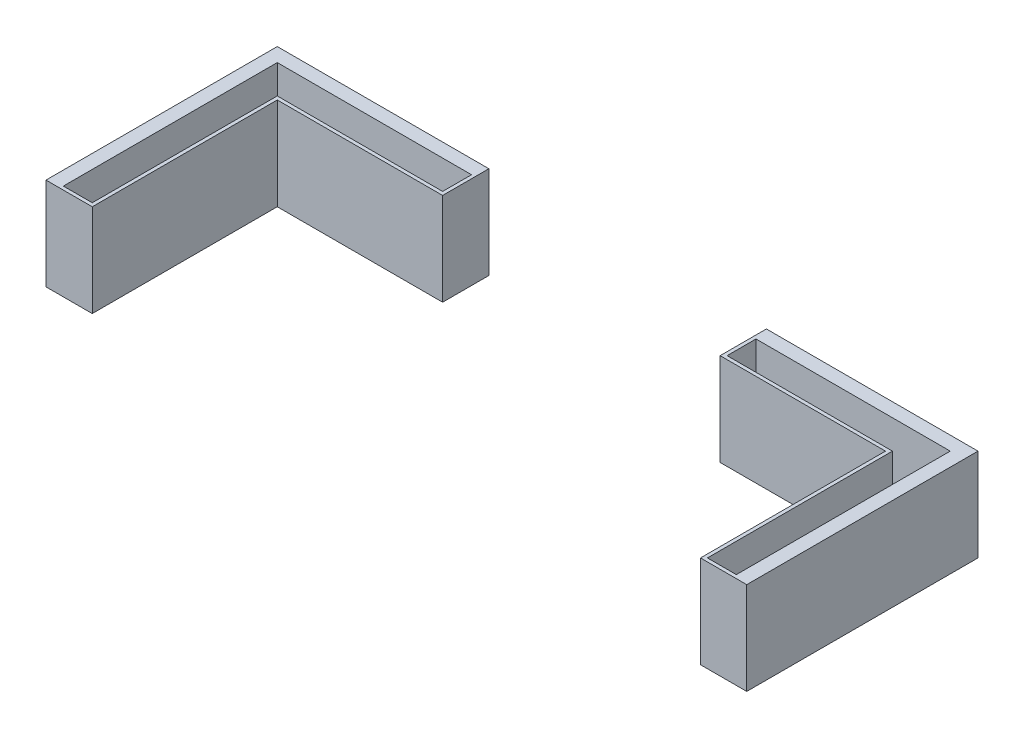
ISO-10303-21;
HEADER;
FILE_DESCRIPTION(('STEP AP214'),'2;1');
FILE_NAME('part.step','',(''),(''),'','','');
FILE_SCHEMA(('AUTOMOTIVE_DESIGN { 1 0 10303 214 1 1 1 1 }'));
ENDSEC;
DATA;
#1=APPLICATION_CONTEXT('core data for automotive mechanical design processes');
#2=APPLICATION_PROTOCOL_DEFINITION('international standard','automotive_design',2000,#1);
#3=PRODUCT_CONTEXT('',#1,'mechanical');
#4=PRODUCT('Part','Part','',(#3));
#5=PRODUCT_RELATED_PRODUCT_CATEGORY('part','',(#4));
#6=PRODUCT_DEFINITION_FORMATION('','',#4);
#7=PRODUCT_DEFINITION_CONTEXT('part definition',#1,'design');
#8=PRODUCT_DEFINITION('design','',#6,#7);
#9=PRODUCT_DEFINITION_SHAPE('','',#8);
#10=(LENGTH_UNIT() NAMED_UNIT(*) SI_UNIT(.MILLI.,.METRE.));
#11=(NAMED_UNIT(*) PLANE_ANGLE_UNIT() SI_UNIT($,.RADIAN.));
#12=(NAMED_UNIT(*) SI_UNIT($,.STERADIAN.) SOLID_ANGLE_UNIT());
#13=UNCERTAINTY_MEASURE_WITH_UNIT(LENGTH_MEASURE(1.E-05),#10,'distance_accuracy_value','');
#14=(GEOMETRIC_REPRESENTATION_CONTEXT(3) GLOBAL_UNCERTAINTY_ASSIGNED_CONTEXT((#13)) GLOBAL_UNIT_ASSIGNED_CONTEXT((#10,
#11,#12)) REPRESENTATION_CONTEXT('',''));
#15=CARTESIAN_POINT('',(0.,0.,0.));
#16=DIRECTION('',(0.,0.,1.));
#17=DIRECTION('',(1.,0.,0.));
#18=AXIS2_PLACEMENT_3D('',#15,#16,#17);
#19=CARTESIAN_POINT('',(-1447.55162576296,-491.370616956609,1000.));
#20=DIRECTION('',(-1.,0.,0.));
#21=DIRECTION('',(0.,0.,1.));
#22=AXIS2_PLACEMENT_3D('',#19,#20,#21);
#23=PLANE('',#22);
#24=DIRECTION('',(0.,1.,0.));
#25=VECTOR('',#24,1.);
#26=CARTESIAN_POINT('',(-1447.55162576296,-491.370616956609,985.));
#27=LINE('',#26,#25);
#28=CARTESIAN_POINT('',(-1447.55162576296,-491.37061695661,985.));
#29=VERTEX_POINT('',#28);
#30=CARTESIAN_POINT('',(-1447.55162576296,-91.3706169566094,985.));
#31=VERTEX_POINT('',#30);
#32=EDGE_CURVE('E12',#29,#31,#27,.T.);
#33=ORIENTED_EDGE('',*,*,#32,.F.);
#34=DIRECTION('',(0.,0.,-1.));
#35=VECTOR('',#34,1.);
#36=CARTESIAN_POINT('',(-1447.55162576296,-491.370616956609,1000.));
#37=LINE('',#36,#35);
#38=CARTESIAN_POINT('',(-1447.55162576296,-491.370616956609,60.));
#39=VERTEX_POINT('',#38);
#40=EDGE_CURVE('E217',#29,#39,#37,.T.);
#41=ORIENTED_EDGE('',*,*,#40,.T.);
#42=DIRECTION('',(0.,1.,0.));
#43=VECTOR('',#42,1.);
#44=CARTESIAN_POINT('',(-1447.55162576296,-491.370616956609,60.));
#45=LINE('',#44,#43);
#46=CARTESIAN_POINT('',(-1447.55162576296,-91.3706169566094,60.));
#47=VERTEX_POINT('',#46);
#48=EDGE_CURVE('E199',#39,#47,#45,.T.);
#49=ORIENTED_EDGE('',*,*,#48,.T.);
#50=DIRECTION('',(0.,0.,-1.));
#51=VECTOR('',#50,1.);
#52=CARTESIAN_POINT('',(-1447.55162576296,-91.3706169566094,1000.));
#53=LINE('',#52,#51);
#54=EDGE_CURVE('E202',#31,#47,#53,.T.);
#55=ORIENTED_EDGE('',*,*,#54,.F.);
#56=EDGE_LOOP('',(#33,#41,#49,#55));
#57=FACE_BOUND('',#56,.T.);
#58=ADVANCED_FACE('F44',(#57),#23,.F.);
#59=CARTESIAN_POINT('',(-1507.55162576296,0.,60.));
#60=DIRECTION('',(-1.,0.,0.));
#61=DIRECTION('',(0.,0.,1.));
#62=AXIS2_PLACEMENT_3D('',#59,#60,#61);
#63=PLANE('',#62);
#64=DIRECTION('',(0.,0.,-1.));
#65=VECTOR('',#64,1.);
#66=CARTESIAN_POINT('',(-1507.55162576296,-91.3706169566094,60.));
#67=LINE('',#66,#65);
#68=CARTESIAN_POINT('',(-1507.55162576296,-91.3706169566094,1000.));
#69=VERTEX_POINT('',#68);
#70=CARTESIAN_POINT('',(-1507.55162576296,-91.3706169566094,0.));
#71=VERTEX_POINT('',#70);
#72=EDGE_CURVE('E237',#69,#71,#67,.T.);
#73=ORIENTED_EDGE('',*,*,#72,.T.);
#74=DIRECTION('',(0.,1.,0.));
#75=VECTOR('',#74,1.);
#76=CARTESIAN_POINT('',(-1507.55162576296,0.,0.));
#77=LINE('',#76,#75);
#78=CARTESIAN_POINT('',(-1507.55162576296,-491.370616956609,0.));
#79=VERTEX_POINT('',#78);
#80=EDGE_CURVE('E218',#79,#71,#77,.T.);
#81=ORIENTED_EDGE('',*,*,#80,.F.);
#82=DIRECTION('',(0.,0.,-1.));
#83=VECTOR('',#82,1.);
#84=CARTESIAN_POINT('',(-1507.55162576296,-491.370616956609,60.));
#85=LINE('',#84,#83);
#86=CARTESIAN_POINT('',(-1507.55162576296,-491.370616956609,1000.));
#87=VERTEX_POINT('',#86);
#88=EDGE_CURVE('E54',#87,#79,#85,.T.);
#89=ORIENTED_EDGE('',*,*,#88,.F.);
#90=DIRECTION('',(0.,-1.,0.));
#91=VECTOR('',#90,1.);
#92=CARTESIAN_POINT('',(-1507.55162576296,-491.370616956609,1000.));
#93=LINE('',#92,#91);
#94=EDGE_CURVE('E143',#69,#87,#93,.T.);
#95=ORIENTED_EDGE('',*,*,#94,.F.);
#96=EDGE_LOOP('',(#73,#81,#89,#95));
#97=FACE_BOUND('',#96,.T.);
#98=ADVANCED_FACE('F46',(#97),#63,.T.);
#99=CARTESIAN_POINT('',(0.,-491.370616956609,60.));
#100=DIRECTION('',(0.,-1.,0.));
#101=DIRECTION('',(0.,0.,-1.));
#102=AXIS2_PLACEMENT_3D('',#99,#100,#101);
#103=PLANE('',#102);
#104=ORIENTED_EDGE('',*,*,#88,.T.);
#105=DIRECTION('',(-1.,0.,0.));
#106=VECTOR('',#105,1.);
#107=CARTESIAN_POINT('',(0.,-491.370616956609,0.));
#108=LINE('',#107,#106);
#109=CARTESIAN_POINT('',(-592.55162576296,-491.370616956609,0.));
#110=VERTEX_POINT('',#109);
#111=EDGE_CURVE('E223',#110,#79,#108,.T.);
#112=ORIENTED_EDGE('',*,*,#111,.F.);
#113=DIRECTION('',(0.,0.,-1.));
#114=VECTOR('',#113,1.);
#115=CARTESIAN_POINT('',(-592.55162576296,-491.370616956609,60.));
#116=LINE('',#115,#114);
#117=CARTESIAN_POINT('',(-592.55162576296,-491.37061695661,200.));
#118=VERTEX_POINT('',#117);
#119=EDGE_CURVE('E242',#118,#110,#116,.T.);
#120=ORIENTED_EDGE('',*,*,#119,.F.);
#121=DIRECTION('',(-1.,0.,0.));
#122=VECTOR('',#121,1.);
#123=CARTESIAN_POINT('',(0.,-491.37061695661,200.));
#124=LINE('',#123,#122);
#125=CARTESIAN_POINT('',(-1307.55162576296,-491.37061695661,200.));
#126=VERTEX_POINT('',#125);
#127=EDGE_CURVE('E159',#118,#126,#124,.T.);
#128=ORIENTED_EDGE('',*,*,#127,.T.);
#129=DIRECTION('',(0.,0.,-1.));
#130=VECTOR('',#129,1.);
#131=CARTESIAN_POINT('',(-1307.55162576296,-491.37061695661,0.));
#132=LINE('',#131,#130);
#133=CARTESIAN_POINT('',(-1307.55162576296,-491.37061695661,1000.));
#134=VERTEX_POINT('',#133);
#135=EDGE_CURVE('E151',#134,#126,#132,.T.);
#136=ORIENTED_EDGE('',*,*,#135,.F.);
#137=DIRECTION('',(1.,0.,0.));
#138=VECTOR('',#137,1.);
#139=CARTESIAN_POINT('',(-1507.55162576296,-491.370616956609,1000.));
#140=LINE('',#139,#138);
#141=EDGE_CURVE('E136',#87,#134,#140,.T.);
#142=ORIENTED_EDGE('',*,*,#141,.F.);
#143=EDGE_LOOP('',(#104,#112,#120,#128,#136,#142));
#144=FACE_BOUND('',#143,.T.);
#145=ORIENTED_EDGE('',*,*,#40,.F.);
#146=DIRECTION('',(1.,0.,0.));
#147=VECTOR('',#146,1.);
#148=CARTESIAN_POINT('',(0.,-491.37061695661,985.));
#149=LINE('',#148,#147);
#150=CARTESIAN_POINT('',(-1322.55162576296,-491.37061695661,985.));
#151=VERTEX_POINT('',#150);
#152=EDGE_CURVE('E161',#29,#151,#149,.T.);
#153=ORIENTED_EDGE('',*,*,#152,.T.);
#154=DIRECTION('',(0.,0.,-1.));
#155=VECTOR('',#154,1.);
#156=CARTESIAN_POINT('',(-1322.55162576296,-491.37061695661,0.));
#157=LINE('',#156,#155);
#158=CARTESIAN_POINT('',(-1322.55162576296,-491.37061695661,185.));
#159=VERTEX_POINT('',#158);
#160=EDGE_CURVE('E155',#151,#159,#157,.T.);
#161=ORIENTED_EDGE('',*,*,#160,.T.);
#162=DIRECTION('',(-1.,0.,0.));
#163=VECTOR('',#162,1.);
#164=CARTESIAN_POINT('',(0.,-491.37061695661,185.));
#165=LINE('',#164,#163);
#166=CARTESIAN_POINT('',(-607.55162576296,-491.37061695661,185.));
#167=VERTEX_POINT('',#166);
#168=EDGE_CURVE('E169',#167,#159,#165,.T.);
#169=ORIENTED_EDGE('',*,*,#168,.F.);
#170=DIRECTION('',(0.,0.,1.));
#171=VECTOR('',#170,1.);
#172=CARTESIAN_POINT('',(-607.55162576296,-491.37061695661,0.));
#173=LINE('',#172,#171);
#174=CARTESIAN_POINT('',(-607.55162576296,-491.37061695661,60.));
#175=VERTEX_POINT('',#174);
#176=EDGE_CURVE('E163',#175,#167,#173,.T.);
#177=ORIENTED_EDGE('',*,*,#176,.F.);
#178=DIRECTION('',(-1.,0.,0.));
#179=VECTOR('',#178,1.);
#180=CARTESIAN_POINT('',(0.,-491.370616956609,60.));
#181=LINE('',#180,#179);
#182=EDGE_CURVE('E48',#175,#39,#181,.T.);
#183=ORIENTED_EDGE('',*,*,#182,.T.);
#184=EDGE_LOOP('',(#145,#153,#161,#169,#177,#183));
#185=FACE_BOUND('',#184,.T.);
#186=ADVANCED_FACE('F157',(#144,#185),#103,.T.);
#187=CARTESIAN_POINT('',(-592.55162576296,0.,60.));
#188=DIRECTION('',(-1.,0.,0.));
#189=DIRECTION('',(0.,0.,1.));
#190=AXIS2_PLACEMENT_3D('',#187,#188,#189);
#191=PLANE('',#190);
#192=DIRECTION('',(0.,1.,0.));
#193=VECTOR('',#192,1.);
#194=CARTESIAN_POINT('',(-592.55162576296,0.,0.));
#195=LINE('',#194,#193);
#196=CARTESIAN_POINT('',(-592.55162576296,-91.3706169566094,0.));
#197=VERTEX_POINT('',#196);
#198=EDGE_CURVE('E229',#110,#197,#195,.T.);
#199=ORIENTED_EDGE('',*,*,#198,.T.);
#200=DIRECTION('',(0.,0.,-1.));
#201=VECTOR('',#200,1.);
#202=CARTESIAN_POINT('',(-592.55162576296,-91.3706169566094,60.));
#203=LINE('',#202,#201);
#204=CARTESIAN_POINT('',(-592.55162576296,-91.3706169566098,200.));
#205=VERTEX_POINT('',#204);
#206=EDGE_CURVE('E239',#205,#197,#203,.T.);
#207=ORIENTED_EDGE('',*,*,#206,.F.);
#208=DIRECTION('',(0.,1.,0.));
#209=VECTOR('',#208,1.);
#210=CARTESIAN_POINT('',(-592.55162576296,-491.37061695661,200.));
#211=LINE('',#210,#209);
#212=EDGE_CURVE('E194',#118,#205,#211,.T.);
#213=ORIENTED_EDGE('',*,*,#212,.F.);
#214=ORIENTED_EDGE('',*,*,#119,.T.);
#215=EDGE_LOOP('',(#199,#207,#213,#214));
#216=FACE_BOUND('',#215,.T.);
#217=ADVANCED_FACE('F252',(#216),#191,.F.);
#218=CARTESIAN_POINT('',(0.,-91.3706169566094,60.));
#219=DIRECTION('',(0.,1.,0.));
#220=DIRECTION('',(0.,0.,1.));
#221=AXIS2_PLACEMENT_3D('',#218,#219,#220);
#222=PLANE('',#221);
#223=DIRECTION('',(1.,0.,0.));
#224=VECTOR('',#223,1.);
#225=CARTESIAN_POINT('',(0.,-91.3706169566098,985.));
#226=LINE('',#225,#224);
#227=CARTESIAN_POINT('',(-1322.55162576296,-91.3706169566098,985.));
#228=VERTEX_POINT('',#227);
#229=EDGE_CURVE('E61',#31,#228,#226,.T.);
#230=ORIENTED_EDGE('',*,*,#229,.F.);
#231=ORIENTED_EDGE('',*,*,#54,.T.);
#232=DIRECTION('',(1.,0.,0.));
#233=VECTOR('',#232,1.);
#234=CARTESIAN_POINT('',(0.,-91.3706169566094,60.));
#235=LINE('',#234,#233);
#236=CARTESIAN_POINT('',(-607.55162576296,-91.3706169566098,60.));
#237=VERTEX_POINT('',#236);
#238=EDGE_CURVE('E210',#47,#237,#235,.T.);
#239=ORIENTED_EDGE('',*,*,#238,.T.);
#240=DIRECTION('',(0.,0.,1.));
#241=VECTOR('',#240,1.);
#242=CARTESIAN_POINT('',(-607.55162576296,-91.3706169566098,0.));
#243=LINE('',#242,#241);
#244=CARTESIAN_POINT('',(-607.55162576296,-91.3706169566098,185.));
#245=VERTEX_POINT('',#244);
#246=EDGE_CURVE('E178',#237,#245,#243,.T.);
#247=ORIENTED_EDGE('',*,*,#246,.T.);
#248=DIRECTION('',(-1.,0.,0.));
#249=VECTOR('',#248,1.);
#250=CARTESIAN_POINT('',(0.,-91.3706169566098,185.));
#251=LINE('',#250,#249);
#252=CARTESIAN_POINT('',(-1322.55162576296,-91.3706169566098,185.));
#253=VERTEX_POINT('',#252);
#254=EDGE_CURVE('E180',#245,#253,#251,.T.);
#255=ORIENTED_EDGE('',*,*,#254,.T.);
#256=DIRECTION('',(0.,0.,-1.));
#257=VECTOR('',#256,1.);
#258=CARTESIAN_POINT('',(-1322.55162576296,-91.3706169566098,0.));
#259=LINE('',#258,#257);
#260=EDGE_CURVE('E165',#228,#253,#259,.T.);
#261=ORIENTED_EDGE('',*,*,#260,.F.);
#262=EDGE_LOOP('',(#230,#231,#239,#247,#255,#261));
#263=FACE_BOUND('',#262,.T.);
#264=DIRECTION('',(1.,0.,0.));
#265=VECTOR('',#264,1.);
#266=CARTESIAN_POINT('',(0.,-91.3706169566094,0.));
#267=LINE('',#266,#265);
#268=EDGE_CURVE('E235',#71,#197,#267,.T.);
#269=ORIENTED_EDGE('',*,*,#268,.F.);
#270=ORIENTED_EDGE('',*,*,#72,.F.);
#271=DIRECTION('',(-1.,0.,0.));
#272=VECTOR('',#271,1.);
#273=CARTESIAN_POINT('',(-1507.55162576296,-91.3706169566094,1000.));
#274=LINE('',#273,#272);
#275=CARTESIAN_POINT('',(-1307.55162576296,-91.3706169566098,1000.));
#276=VERTEX_POINT('',#275);
#277=EDGE_CURVE('E146',#276,#69,#274,.T.);
#278=ORIENTED_EDGE('',*,*,#277,.F.);
#279=DIRECTION('',(0.,0.,-1.));
#280=VECTOR('',#279,1.);
#281=CARTESIAN_POINT('',(-1307.55162576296,-91.3706169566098,0.));
#282=LINE('',#281,#280);
#283=CARTESIAN_POINT('',(-1307.55162576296,-91.3706169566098,200.));
#284=VERTEX_POINT('',#283);
#285=EDGE_CURVE('E153',#276,#284,#282,.T.);
#286=ORIENTED_EDGE('',*,*,#285,.T.);
#287=DIRECTION('',(-1.,0.,0.));
#288=VECTOR('',#287,1.);
#289=CARTESIAN_POINT('',(0.,-91.3706169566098,200.));
#290=LINE('',#289,#288);
#291=EDGE_CURVE('E175',#205,#284,#290,.T.);
#292=ORIENTED_EDGE('',*,*,#291,.F.);
#293=ORIENTED_EDGE('',*,*,#206,.T.);
#294=EDGE_LOOP('',(#269,#270,#278,#286,#292,#293));
#295=FACE_BOUND('',#294,.T.);
#296=ADVANCED_FACE('F248',(#263,#295),#222,.T.);
#297=CARTESIAN_POINT('',(0.,0.,60.));
#298=DIRECTION('',(0.,0.,1.));
#299=DIRECTION('',(1.,0.,0.));
#300=AXIS2_PLACEMENT_3D('',#297,#298,#299);
#301=PLANE('',#300);
#302=DIRECTION('',(0.,-1.,0.));
#303=VECTOR('',#302,1.);
#304=CARTESIAN_POINT('',(-607.55162576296,0.,60.));
#305=LINE('',#304,#303);
#306=EDGE_CURVE('E188',#237,#175,#305,.T.);
#307=ORIENTED_EDGE('',*,*,#306,.F.);
#308=ORIENTED_EDGE('',*,*,#238,.F.);
#309=ORIENTED_EDGE('',*,*,#48,.F.);
#310=ORIENTED_EDGE('',*,*,#182,.F.);
#311=EDGE_LOOP('',(#307,#308,#309,#310));
#312=FACE_BOUND('',#311,.T.);
#313=ADVANCED_FACE('F274',(#312),#301,.T.);
#314=CARTESIAN_POINT('',(0.,0.,0.));
#315=DIRECTION('',(0.,0.,1.));
#316=DIRECTION('',(1.,0.,0.));
#317=AXIS2_PLACEMENT_3D('',#314,#315,#316);
#318=PLANE('',#317);
#319=ORIENTED_EDGE('',*,*,#268,.T.);
#320=ORIENTED_EDGE('',*,*,#198,.F.);
#321=ORIENTED_EDGE('',*,*,#111,.T.);
#322=ORIENTED_EDGE('',*,*,#80,.T.);
#323=EDGE_LOOP('',(#319,#320,#321,#322));
#324=FACE_BOUND('',#323,.T.);
#325=ADVANCED_FACE('F246',(#324),#318,.F.);
#326=CARTESIAN_POINT('',(0.,0.,1000.));
#327=DIRECTION('',(0.,0.,-1.));
#328=DIRECTION('',(-1.,0.,0.));
#329=AXIS2_PLACEMENT_3D('',#326,#327,#328);
#330=PLANE('',#329);
#331=ORIENTED_EDGE('',*,*,#94,.T.);
#332=ORIENTED_EDGE('',*,*,#141,.T.);
#333=DIRECTION('',(0.,1.,0.));
#334=VECTOR('',#333,1.);
#335=CARTESIAN_POINT('',(-1307.55162576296,-491.37061695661,1000.));
#336=LINE('',#335,#334);
#337=EDGE_CURVE('E140',#134,#276,#336,.T.);
#338=ORIENTED_EDGE('',*,*,#337,.T.);
#339=ORIENTED_EDGE('',*,*,#277,.T.);
#340=EDGE_LOOP('',(#331,#332,#338,#339));
#341=FACE_BOUND('',#340,.T.);
#342=ADVANCED_FACE('F138',(#341),#330,.F.);
#343=CARTESIAN_POINT('',(0.,-491.37061695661,985.));
#344=DIRECTION('',(0.,0.,1.));
#345=DIRECTION('',(1.,0.,0.));
#346=AXIS2_PLACEMENT_3D('',#343,#344,#345);
#347=PLANE('',#346);
#348=ORIENTED_EDGE('',*,*,#152,.F.);
#349=ORIENTED_EDGE('',*,*,#32,.T.);
#350=ORIENTED_EDGE('',*,*,#229,.T.);
#351=DIRECTION('',(0.,1.,0.));
#352=VECTOR('',#351,1.);
#353=CARTESIAN_POINT('',(-1322.55162576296,-491.37061695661,985.));
#354=LINE('',#353,#352);
#355=EDGE_CURVE('E185',#151,#228,#354,.T.);
#356=ORIENTED_EDGE('',*,*,#355,.F.);
#357=EDGE_LOOP('',(#348,#349,#350,#356));
#358=FACE_BOUND('',#357,.T.);
#359=ADVANCED_FACE('F310',(#358),#347,.F.);
#360=CARTESIAN_POINT('',(-1322.55162576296,-491.37061695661,0.));
#361=DIRECTION('',(1.,0.,0.));
#362=DIRECTION('',(0.,0.,-1.));
#363=AXIS2_PLACEMENT_3D('',#360,#361,#362);
#364=PLANE('',#363);
#365=ORIENTED_EDGE('',*,*,#260,.T.);
#366=DIRECTION('',(0.,1.,0.));
#367=VECTOR('',#366,1.);
#368=CARTESIAN_POINT('',(-1322.55162576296,-491.37061695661,185.));
#369=LINE('',#368,#367);
#370=EDGE_CURVE('E189',#159,#253,#369,.T.);
#371=ORIENTED_EDGE('',*,*,#370,.F.);
#372=ORIENTED_EDGE('',*,*,#160,.F.);
#373=ORIENTED_EDGE('',*,*,#355,.T.);
#374=EDGE_LOOP('',(#365,#371,#372,#373));
#375=FACE_BOUND('',#374,.T.);
#376=ADVANCED_FACE('F316',(#375),#364,.F.);
#377=CARTESIAN_POINT('',(0.,-491.37061695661,185.));
#378=DIRECTION('',(0.,0.,-1.));
#379=DIRECTION('',(-1.,0.,0.));
#380=AXIS2_PLACEMENT_3D('',#377,#378,#379);
#381=PLANE('',#380);
#382=ORIENTED_EDGE('',*,*,#254,.F.);
#383=DIRECTION('',(0.,1.,0.));
#384=VECTOR('',#383,1.);
#385=CARTESIAN_POINT('',(-607.55162576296,-491.37061695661,185.));
#386=LINE('',#385,#384);
#387=EDGE_CURVE('E191',#167,#245,#386,.T.);
#388=ORIENTED_EDGE('',*,*,#387,.F.);
#389=ORIENTED_EDGE('',*,*,#168,.T.);
#390=ORIENTED_EDGE('',*,*,#370,.T.);
#391=EDGE_LOOP('',(#382,#388,#389,#390));
#392=FACE_BOUND('',#391,.T.);
#393=ADVANCED_FACE('F263',(#392),#381,.T.);
#394=CARTESIAN_POINT('',(-607.55162576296,-491.37061695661,0.));
#395=DIRECTION('',(-1.,0.,0.));
#396=DIRECTION('',(0.,0.,1.));
#397=AXIS2_PLACEMENT_3D('',#394,#395,#396);
#398=PLANE('',#397);
#399=ORIENTED_EDGE('',*,*,#246,.F.);
#400=ORIENTED_EDGE('',*,*,#306,.T.);
#401=ORIENTED_EDGE('',*,*,#176,.T.);
#402=ORIENTED_EDGE('',*,*,#387,.T.);
#403=EDGE_LOOP('',(#399,#400,#401,#402));
#404=FACE_BOUND('',#403,.T.);
#405=ADVANCED_FACE('F256',(#404),#398,.T.);
#406=CARTESIAN_POINT('',(0.,-491.37061695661,200.));
#407=DIRECTION('',(0.,0.,-1.));
#408=DIRECTION('',(-1.,0.,0.));
#409=AXIS2_PLACEMENT_3D('',#406,#407,#408);
#410=PLANE('',#409);
#411=ORIENTED_EDGE('',*,*,#291,.T.);
#412=DIRECTION('',(0.,1.,0.));
#413=VECTOR('',#412,1.);
#414=CARTESIAN_POINT('',(-1307.55162576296,-491.37061695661,200.));
#415=LINE('',#414,#413);
#416=EDGE_CURVE('E154',#126,#284,#415,.T.);
#417=ORIENTED_EDGE('',*,*,#416,.F.);
#418=ORIENTED_EDGE('',*,*,#127,.F.);
#419=ORIENTED_EDGE('',*,*,#212,.T.);
#420=EDGE_LOOP('',(#411,#417,#418,#419));
#421=FACE_BOUND('',#420,.T.);
#422=ADVANCED_FACE('F254',(#421),#410,.F.);
#423=CARTESIAN_POINT('',(-1307.55162576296,-491.37061695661,0.));
#424=DIRECTION('',(1.,0.,0.));
#425=DIRECTION('',(0.,0.,-1.));
#426=AXIS2_PLACEMENT_3D('',#423,#424,#425);
#427=PLANE('',#426);
#428=ORIENTED_EDGE('',*,*,#285,.F.);
#429=ORIENTED_EDGE('',*,*,#337,.F.);
#430=ORIENTED_EDGE('',*,*,#135,.T.);
#431=ORIENTED_EDGE('',*,*,#416,.T.);
#432=EDGE_LOOP('',(#428,#429,#430,#431));
#433=FACE_BOUND('',#432,.T.);
#434=ADVANCED_FACE('F150',(#433),#427,.T.);
#435=CLOSED_SHELL('',(#58,#98,#186,#217,#296,#313,#325,#342,#359,#376,#393,#405,#422,#434));
#436=MANIFOLD_SOLID_BREP('B2',#435);
#437=CARTESIAN_POINT('',(0.,0.,60.));
#438=DIRECTION('',(0.,0.,1.));
#439=DIRECTION('',(1.,0.,0.));
#440=AXIS2_PLACEMENT_3D('',#437,#438,#439);
#441=PLANE('',#440);
#442=DIRECTION('',(1.,0.,0.));
#443=VECTOR('',#442,1.);
#444=CARTESIAN_POINT('',(0.,-91.3706169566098,60.));
#445=LINE('',#444,#443);
#446=CARTESIAN_POINT('',(622.44837423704,-91.3706169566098,60.));
#447=VERTEX_POINT('',#446);
#448=CARTESIAN_POINT('',(1462.44837423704,-91.3706169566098,60.));
#449=VERTEX_POINT('',#448);
#450=EDGE_CURVE('E412',#447,#449,#445,.T.);
#451=ORIENTED_EDGE('',*,*,#450,.F.);
#452=DIRECTION('',(0.,1.,0.));
#453=VECTOR('',#452,1.);
#454=CARTESIAN_POINT('',(622.44837423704,-491.37061695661,60.));
#455=LINE('',#454,#453);
#456=CARTESIAN_POINT('',(622.44837423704,-491.37061695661,60.));
#457=VERTEX_POINT('',#456);
#458=EDGE_CURVE('E596',#457,#447,#455,.T.);
#459=ORIENTED_EDGE('',*,*,#458,.F.);
#460=DIRECTION('',(-1.,0.,0.));
#461=VECTOR('',#460,1.);
#462=CARTESIAN_POINT('',(0.,-491.370616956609,60.));
#463=LINE('',#462,#461);
#464=CARTESIAN_POINT('',(1462.44837423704,-491.370616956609,60.));
#465=VERTEX_POINT('',#464);
#466=EDGE_CURVE('E539',#465,#457,#463,.T.);
#467=ORIENTED_EDGE('',*,*,#466,.F.);
#468=DIRECTION('',(0.,-1.,0.));
#469=VECTOR('',#468,1.);
#470=CARTESIAN_POINT('',(1462.44837423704,-491.370616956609,60.));
#471=LINE('',#470,#469);
#472=EDGE_CURVE('E522',#449,#465,#471,.T.);
#473=ORIENTED_EDGE('',*,*,#472,.F.);
#474=EDGE_LOOP('',(#451,#459,#467,#473));
#475=FACE_BOUND('',#474,.T.);
#476=ADVANCED_FACE('F408',(#475),#441,.T.);
#477=CARTESIAN_POINT('',(0.,-491.370616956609,60.));
#478=DIRECTION('',(0.,-1.,0.));
#479=DIRECTION('',(0.,0.,-1.));
#480=AXIS2_PLACEMENT_3D('',#477,#478,#479);
#481=PLANE('',#480);
#482=ORIENTED_EDGE('',*,*,#466,.T.);
#483=DIRECTION('',(0.,0.,1.));
#484=VECTOR('',#483,1.);
#485=CARTESIAN_POINT('',(622.44837423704,-491.37061695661,0.));
#486=LINE('',#485,#484);
#487=CARTESIAN_POINT('',(622.44837423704,-491.37061695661,185.));
#488=VERTEX_POINT('',#487);
#489=EDGE_CURVE('E615',#457,#488,#486,.T.);
#490=ORIENTED_EDGE('',*,*,#489,.T.);
#491=DIRECTION('',(1.,0.,0.));
#492=VECTOR('',#491,1.);
#493=CARTESIAN_POINT('',(0.,-491.37061695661,185.));
#494=LINE('',#493,#492);
#495=CARTESIAN_POINT('',(1337.44837423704,-491.37061695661,185.));
#496=VERTEX_POINT('',#495);
#497=EDGE_CURVE('E631',#488,#496,#494,.T.);
#498=ORIENTED_EDGE('',*,*,#497,.T.);
#499=DIRECTION('',(0.,0.,-1.));
#500=VECTOR('',#499,1.);
#501=CARTESIAN_POINT('',(1337.44837423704,-491.37061695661,0.));
#502=LINE('',#501,#500);
#503=CARTESIAN_POINT('',(1337.44837423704,-491.37061695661,985.));
#504=VERTEX_POINT('',#503);
#505=EDGE_CURVE('E516',#504,#496,#502,.T.);
#506=ORIENTED_EDGE('',*,*,#505,.F.);
#507=DIRECTION('',(-1.,0.,0.));
#508=VECTOR('',#507,1.);
#509=CARTESIAN_POINT('',(0.,-491.37061695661,985.));
#510=LINE('',#509,#508);
#511=CARTESIAN_POINT('',(1462.44837423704,-491.37061695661,985.));
#512=VERTEX_POINT('',#511);
#513=EDGE_CURVE('E501',#512,#504,#510,.T.);
#514=ORIENTED_EDGE('',*,*,#513,.F.);
#515=DIRECTION('',(0.,0.,-1.));
#516=VECTOR('',#515,1.);
#517=CARTESIAN_POINT('',(1462.44837423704,-491.370616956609,1000.));
#518=LINE('',#517,#516);
#519=EDGE_CURVE('E513',#512,#465,#518,.T.);
#520=ORIENTED_EDGE('',*,*,#519,.T.);
#521=EDGE_LOOP('',(#482,#490,#498,#506,#514,#520));
#522=FACE_BOUND('',#521,.T.);
#523=DIRECTION('',(-1.,0.,0.));
#524=VECTOR('',#523,1.);
#525=CARTESIAN_POINT('',(0.,-491.370616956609,0.));
#526=LINE('',#525,#524);
#527=CARTESIAN_POINT('',(1522.44837423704,-491.370616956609,0.));
#528=VERTEX_POINT('',#527);
#529=CARTESIAN_POINT('',(607.44837423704,-491.370616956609,0.));
#530=VERTEX_POINT('',#529);
#531=EDGE_CURVE('E526',#528,#530,#526,.T.);
#532=ORIENTED_EDGE('',*,*,#531,.F.);
#533=DIRECTION('',(0.,0.,-1.));
#534=VECTOR('',#533,1.);
#535=CARTESIAN_POINT('',(1522.44837423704,-491.370616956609,60.));
#536=LINE('',#535,#534);
#537=CARTESIAN_POINT('',(1522.44837423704,-491.370616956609,1000.));
#538=VERTEX_POINT('',#537);
#539=EDGE_CURVE('E42',#538,#528,#536,.T.);
#540=ORIENTED_EDGE('',*,*,#539,.F.);
#541=DIRECTION('',(1.,0.,0.));
#542=VECTOR('',#541,1.);
#543=CARTESIAN_POINT('',(1522.44837423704,-491.370616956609,1000.));
#544=LINE('',#543,#542);
#545=CARTESIAN_POINT('',(1322.44837423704,-491.37061695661,1000.));
#546=VERTEX_POINT('',#545);
#547=EDGE_CURVE('E524',#546,#538,#544,.T.);
#548=ORIENTED_EDGE('',*,*,#547,.F.);
#549=DIRECTION('',(0.,0.,-1.));
#550=VECTOR('',#549,1.);
#551=CARTESIAN_POINT('',(1322.44837423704,-491.37061695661,0.));
#552=LINE('',#551,#550);
#553=CARTESIAN_POINT('',(1322.44837423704,-491.37061695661,200.));
#554=VERTEX_POINT('',#553);
#555=EDGE_CURVE('E507',#546,#554,#552,.T.);
#556=ORIENTED_EDGE('',*,*,#555,.T.);
#557=DIRECTION('',(1.,0.,0.));
#558=VECTOR('',#557,1.);
#559=CARTESIAN_POINT('',(0.,-491.37061695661,200.));
#560=LINE('',#559,#558);
#561=CARTESIAN_POINT('',(607.44837423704,-491.37061695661,200.));
#562=VERTEX_POINT('',#561);
#563=EDGE_CURVE('E613',#562,#554,#560,.T.);
#564=ORIENTED_EDGE('',*,*,#563,.F.);
#565=DIRECTION('',(0.,0.,-1.));
#566=VECTOR('',#565,1.);
#567=CARTESIAN_POINT('',(607.44837423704,-491.370616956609,60.));
#568=LINE('',#567,#566);
#569=EDGE_CURVE('E557',#562,#530,#568,.T.);
#570=ORIENTED_EDGE('',*,*,#569,.T.);
#571=EDGE_LOOP('',(#532,#540,#548,#556,#564,#570));
#572=FACE_BOUND('',#571,.T.);
#573=ADVANCED_FACE('F410',(#522,#572),#481,.T.);
#574=CARTESIAN_POINT('',(1522.44837423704,0.,60.));
#575=DIRECTION('',(-1.,0.,0.));
#576=DIRECTION('',(0.,0.,1.));
#577=AXIS2_PLACEMENT_3D('',#574,#575,#576);
#578=PLANE('',#577);
#579=DIRECTION('',(0.,1.,0.));
#580=VECTOR('',#579,1.);
#581=CARTESIAN_POINT('',(1522.44837423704,0.,0.));
#582=LINE('',#581,#580);
#583=CARTESIAN_POINT('',(1522.44837423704,-91.3706169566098,0.));
#584=VERTEX_POINT('',#583);
#585=EDGE_CURVE('E548',#528,#584,#582,.T.);
#586=ORIENTED_EDGE('',*,*,#585,.T.);
#587=DIRECTION('',(0.,0.,-1.));
#588=VECTOR('',#587,1.);
#589=CARTESIAN_POINT('',(1522.44837423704,-91.3706169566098,60.));
#590=LINE('',#589,#588);
#591=CARTESIAN_POINT('',(1522.44837423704,-91.3706169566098,1000.));
#592=VERTEX_POINT('',#591);
#593=EDGE_CURVE('E418',#592,#584,#590,.T.);
#594=ORIENTED_EDGE('',*,*,#593,.F.);
#595=DIRECTION('',(0.,1.,0.));
#596=VECTOR('',#595,1.);
#597=CARTESIAN_POINT('',(1522.44837423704,-491.370616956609,1000.));
#598=LINE('',#597,#596);
#599=EDGE_CURVE('E537',#538,#592,#598,.T.);
#600=ORIENTED_EDGE('',*,*,#599,.F.);
#601=ORIENTED_EDGE('',*,*,#539,.T.);
#602=EDGE_LOOP('',(#586,#594,#600,#601));
#603=FACE_BOUND('',#602,.T.);
#604=ADVANCED_FACE('F570',(#603),#578,.F.);
#605=CARTESIAN_POINT('',(0.,-91.3706169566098,60.));
#606=DIRECTION('',(0.,1.,0.));
#607=DIRECTION('',(0.,0.,1.));
#608=AXIS2_PLACEMENT_3D('',#605,#606,#607);
#609=PLANE('',#608);
#610=DIRECTION('',(0.,0.,1.));
#611=VECTOR('',#610,1.);
#612=CARTESIAN_POINT('',(622.44837423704,-91.3706169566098,0.));
#613=LINE('',#612,#611);
#614=CARTESIAN_POINT('',(622.44837423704,-91.3706169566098,185.));
#615=VERTEX_POINT('',#614);
#616=EDGE_CURVE('E426',#447,#615,#613,.T.);
#617=ORIENTED_EDGE('',*,*,#616,.F.);
#618=ORIENTED_EDGE('',*,*,#450,.T.);
#619=DIRECTION('',(0.,0.,-1.));
#620=VECTOR('',#619,1.);
#621=CARTESIAN_POINT('',(1462.44837423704,-91.3706169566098,1000.));
#622=LINE('',#621,#620);
#623=CARTESIAN_POINT('',(1462.44837423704,-91.3706169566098,985.));
#624=VERTEX_POINT('',#623);
#625=EDGE_CURVE('E523',#624,#449,#622,.T.);
#626=ORIENTED_EDGE('',*,*,#625,.F.);
#627=DIRECTION('',(-1.,0.,0.));
#628=VECTOR('',#627,1.);
#629=CARTESIAN_POINT('',(0.,-91.3706169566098,985.));
#630=LINE('',#629,#628);
#631=CARTESIAN_POINT('',(1337.44837423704,-91.3706169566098,985.));
#632=VERTEX_POINT('',#631);
#633=EDGE_CURVE('E503',#624,#632,#630,.T.);
#634=ORIENTED_EDGE('',*,*,#633,.T.);
#635=DIRECTION('',(0.,0.,-1.));
#636=VECTOR('',#635,1.);
#637=CARTESIAN_POINT('',(1337.44837423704,-91.3706169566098,0.));
#638=LINE('',#637,#636);
#639=CARTESIAN_POINT('',(1337.44837423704,-91.3706169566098,185.));
#640=VERTEX_POINT('',#639);
#641=EDGE_CURVE('E620',#632,#640,#638,.T.);
#642=ORIENTED_EDGE('',*,*,#641,.T.);
#643=DIRECTION('',(1.,0.,0.));
#644=VECTOR('',#643,1.);
#645=CARTESIAN_POINT('',(0.,-91.3706169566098,185.));
#646=LINE('',#645,#644);
#647=EDGE_CURVE('E587',#615,#640,#646,.T.);
#648=ORIENTED_EDGE('',*,*,#647,.F.);
#649=EDGE_LOOP('',(#617,#618,#626,#634,#642,#648));
#650=FACE_BOUND('',#649,.T.);
#651=DIRECTION('',(1.,0.,0.));
#652=VECTOR('',#651,1.);
#653=CARTESIAN_POINT('',(0.,-91.3706169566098,0.));
#654=LINE('',#653,#652);
#655=CARTESIAN_POINT('',(607.44837423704,-91.3706169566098,0.));
#656=VERTEX_POINT('',#655);
#657=EDGE_CURVE('E551',#656,#584,#654,.T.);
#658=ORIENTED_EDGE('',*,*,#657,.F.);
#659=DIRECTION('',(0.,0.,-1.));
#660=VECTOR('',#659,1.);
#661=CARTESIAN_POINT('',(607.44837423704,-91.3706169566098,60.));
#662=LINE('',#661,#660);
#663=CARTESIAN_POINT('',(607.44837423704,-91.3706169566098,200.));
#664=VERTEX_POINT('',#663);
#665=EDGE_CURVE('E559',#664,#656,#662,.T.);
#666=ORIENTED_EDGE('',*,*,#665,.F.);
#667=DIRECTION('',(1.,0.,0.));
#668=VECTOR('',#667,1.);
#669=CARTESIAN_POINT('',(0.,-91.3706169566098,200.));
#670=LINE('',#669,#668);
#671=CARTESIAN_POINT('',(1322.44837423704,-91.3706169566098,200.));
#672=VERTEX_POINT('',#671);
#673=EDGE_CURVE('E582',#664,#672,#670,.T.);
#674=ORIENTED_EDGE('',*,*,#673,.T.);
#675=DIRECTION('',(0.,0.,-1.));
#676=VECTOR('',#675,1.);
#677=CARTESIAN_POINT('',(1322.44837423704,-91.3706169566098,0.));
#678=LINE('',#677,#676);
#679=CARTESIAN_POINT('',(1322.44837423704,-91.3706169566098,1000.));
#680=VERTEX_POINT('',#679);
#681=EDGE_CURVE('E517',#680,#672,#678,.T.);
#682=ORIENTED_EDGE('',*,*,#681,.F.);
#683=DIRECTION('',(-1.,0.,0.));
#684=VECTOR('',#683,1.);
#685=CARTESIAN_POINT('',(1522.44837423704,-91.3706169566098,1000.));
#686=LINE('',#685,#684);
#687=EDGE_CURVE('E528',#592,#680,#686,.T.);
#688=ORIENTED_EDGE('',*,*,#687,.F.);
#689=ORIENTED_EDGE('',*,*,#593,.T.);
#690=EDGE_LOOP('',(#658,#666,#674,#682,#688,#689));
#691=FACE_BOUND('',#690,.T.);
#692=ADVANCED_FACE('F564',(#650,#691),#609,.T.);
#693=CARTESIAN_POINT('',(607.44837423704,0.,60.));
#694=DIRECTION('',(-1.,0.,0.));
#695=DIRECTION('',(0.,0.,1.));
#696=AXIS2_PLACEMENT_3D('',#693,#694,#695);
#697=PLANE('',#696);
#698=DIRECTION('',(0.,1.,0.));
#699=VECTOR('',#698,1.);
#700=CARTESIAN_POINT('',(607.44837423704,0.,0.));
#701=LINE('',#700,#699);
#702=EDGE_CURVE('E554',#530,#656,#701,.T.);
#703=ORIENTED_EDGE('',*,*,#702,.F.);
#704=ORIENTED_EDGE('',*,*,#569,.F.);
#705=DIRECTION('',(0.,1.,0.));
#706=VECTOR('',#705,1.);
#707=CARTESIAN_POINT('',(607.44837423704,-491.37061695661,200.));
#708=LINE('',#707,#706);
#709=EDGE_CURVE('E579',#562,#664,#708,.T.);
#710=ORIENTED_EDGE('',*,*,#709,.T.);
#711=ORIENTED_EDGE('',*,*,#665,.T.);
#712=EDGE_LOOP('',(#703,#704,#710,#711));
#713=FACE_BOUND('',#712,.T.);
#714=ADVANCED_FACE('F576',(#713),#697,.T.);
#715=CARTESIAN_POINT('',(0.,0.,0.));
#716=DIRECTION('',(0.,0.,1.));
#717=DIRECTION('',(1.,0.,0.));
#718=AXIS2_PLACEMENT_3D('',#715,#716,#717);
#719=PLANE('',#718);
#720=ORIENTED_EDGE('',*,*,#531,.T.);
#721=ORIENTED_EDGE('',*,*,#702,.T.);
#722=ORIENTED_EDGE('',*,*,#657,.T.);
#723=ORIENTED_EDGE('',*,*,#585,.F.);
#724=EDGE_LOOP('',(#720,#721,#722,#723));
#725=FACE_BOUND('',#724,.T.);
#726=ADVANCED_FACE('F573',(#725),#719,.F.);
#727=CARTESIAN_POINT('',(1462.44837423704,-491.370616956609,1000.));
#728=DIRECTION('',(1.,0.,0.));
#729=DIRECTION('',(0.,0.,-1.));
#730=AXIS2_PLACEMENT_3D('',#727,#728,#729);
#731=PLANE('',#730);
#732=ORIENTED_EDGE('',*,*,#519,.F.);
#733=DIRECTION('',(0.,1.,0.));
#734=VECTOR('',#733,1.);
#735=CARTESIAN_POINT('',(1462.44837423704,-491.37061695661,985.));
#736=LINE('',#735,#734);
#737=EDGE_CURVE('E498',#512,#624,#736,.T.);
#738=ORIENTED_EDGE('',*,*,#737,.T.);
#739=ORIENTED_EDGE('',*,*,#625,.T.);
#740=ORIENTED_EDGE('',*,*,#472,.T.);
#741=EDGE_LOOP('',(#732,#738,#739,#740));
#742=FACE_BOUND('',#741,.T.);
#743=ADVANCED_FACE('F520',(#742),#731,.F.);
#744=CARTESIAN_POINT('',(0.,0.,1000.));
#745=DIRECTION('',(0.,0.,1.));
#746=DIRECTION('',(1.,0.,0.));
#747=AXIS2_PLACEMENT_3D('',#744,#745,#746);
#748=PLANE('',#747);
#749=ORIENTED_EDGE('',*,*,#599,.T.);
#750=ORIENTED_EDGE('',*,*,#687,.T.);
#751=DIRECTION('',(0.,1.,0.));
#752=VECTOR('',#751,1.);
#753=CARTESIAN_POINT('',(1322.44837423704,-491.37061695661,1000.));
#754=LINE('',#753,#752);
#755=EDGE_CURVE('E538',#546,#680,#754,.T.);
#756=ORIENTED_EDGE('',*,*,#755,.F.);
#757=ORIENTED_EDGE('',*,*,#547,.T.);
#758=EDGE_LOOP('',(#749,#750,#756,#757));
#759=FACE_BOUND('',#758,.T.);
#760=ADVANCED_FACE('F606',(#759),#748,.T.);
#761=CARTESIAN_POINT('',(1322.44837423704,-491.37061695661,0.));
#762=DIRECTION('',(1.,0.,0.));
#763=DIRECTION('',(0.,0.,-1.));
#764=AXIS2_PLACEMENT_3D('',#761,#762,#763);
#765=PLANE('',#764);
#766=ORIENTED_EDGE('',*,*,#681,.T.);
#767=DIRECTION('',(0.,1.,0.));
#768=VECTOR('',#767,1.);
#769=CARTESIAN_POINT('',(1322.44837423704,-491.37061695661,200.));
#770=LINE('',#769,#768);
#771=EDGE_CURVE('E593',#554,#672,#770,.T.);
#772=ORIENTED_EDGE('',*,*,#771,.F.);
#773=ORIENTED_EDGE('',*,*,#555,.F.);
#774=ORIENTED_EDGE('',*,*,#755,.T.);
#775=EDGE_LOOP('',(#766,#772,#773,#774));
#776=FACE_BOUND('',#775,.T.);
#777=ADVANCED_FACE('F609',(#776),#765,.F.);
#778=CARTESIAN_POINT('',(0.,-491.37061695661,200.));
#779=DIRECTION('',(0.,0.,1.));
#780=DIRECTION('',(1.,0.,0.));
#781=AXIS2_PLACEMENT_3D('',#778,#779,#780);
#782=PLANE('',#781);
#783=ORIENTED_EDGE('',*,*,#673,.F.);
#784=ORIENTED_EDGE('',*,*,#709,.F.);
#785=ORIENTED_EDGE('',*,*,#563,.T.);
#786=ORIENTED_EDGE('',*,*,#771,.T.);
#787=EDGE_LOOP('',(#783,#784,#785,#786));
#788=FACE_BOUND('',#787,.T.);
#789=ADVANCED_FACE('F684',(#788),#782,.T.);
#790=CARTESIAN_POINT('',(622.44837423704,-491.37061695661,0.));
#791=DIRECTION('',(-1.,0.,0.));
#792=DIRECTION('',(0.,0.,1.));
#793=AXIS2_PLACEMENT_3D('',#790,#791,#792);
#794=PLANE('',#793);
#795=ORIENTED_EDGE('',*,*,#616,.T.);
#796=DIRECTION('',(0.,1.,0.));
#797=VECTOR('',#796,1.);
#798=CARTESIAN_POINT('',(622.44837423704,-491.37061695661,185.));
#799=LINE('',#798,#797);
#800=EDGE_CURVE('E598',#488,#615,#799,.T.);
#801=ORIENTED_EDGE('',*,*,#800,.F.);
#802=ORIENTED_EDGE('',*,*,#489,.F.);
#803=ORIENTED_EDGE('',*,*,#458,.T.);
#804=EDGE_LOOP('',(#795,#801,#802,#803));
#805=FACE_BOUND('',#804,.T.);
#806=ADVANCED_FACE('F636',(#805),#794,.F.);
#807=CARTESIAN_POINT('',(0.,-491.37061695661,185.));
#808=DIRECTION('',(0.,0.,1.));
#809=DIRECTION('',(1.,0.,0.));
#810=AXIS2_PLACEMENT_3D('',#807,#808,#809);
#811=PLANE('',#810);
#812=ORIENTED_EDGE('',*,*,#647,.T.);
#813=DIRECTION('',(0.,1.,0.));
#814=VECTOR('',#813,1.);
#815=CARTESIAN_POINT('',(1337.44837423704,-491.37061695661,185.));
#816=LINE('',#815,#814);
#817=EDGE_CURVE('E601',#496,#640,#816,.T.);
#818=ORIENTED_EDGE('',*,*,#817,.F.);
#819=ORIENTED_EDGE('',*,*,#497,.F.);
#820=ORIENTED_EDGE('',*,*,#800,.T.);
#821=EDGE_LOOP('',(#812,#818,#819,#820));
#822=FACE_BOUND('',#821,.T.);
#823=ADVANCED_FACE('F625',(#822),#811,.F.);
#824=CARTESIAN_POINT('',(1337.44837423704,-491.37061695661,0.));
#825=DIRECTION('',(1.,0.,0.));
#826=DIRECTION('',(0.,0.,-1.));
#827=AXIS2_PLACEMENT_3D('',#824,#825,#826);
#828=PLANE('',#827);
#829=ORIENTED_EDGE('',*,*,#641,.F.);
#830=DIRECTION('',(0.,1.,0.));
#831=VECTOR('',#830,1.);
#832=CARTESIAN_POINT('',(1337.44837423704,-491.37061695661,985.));
#833=LINE('',#832,#831);
#834=EDGE_CURVE('E506',#504,#632,#833,.T.);
#835=ORIENTED_EDGE('',*,*,#834,.F.);
#836=ORIENTED_EDGE('',*,*,#505,.T.);
#837=ORIENTED_EDGE('',*,*,#817,.T.);
#838=EDGE_LOOP('',(#829,#835,#836,#837));
#839=FACE_BOUND('',#838,.T.);
#840=ADVANCED_FACE('F630',(#839),#828,.T.);
#841=CARTESIAN_POINT('',(0.,-491.37061695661,985.));
#842=DIRECTION('',(0.,0.,-1.));
#843=DIRECTION('',(-1.,0.,0.));
#844=AXIS2_PLACEMENT_3D('',#841,#842,#843);
#845=PLANE('',#844);
#846=ORIENTED_EDGE('',*,*,#633,.F.);
#847=ORIENTED_EDGE('',*,*,#737,.F.);
#848=ORIENTED_EDGE('',*,*,#513,.T.);
#849=ORIENTED_EDGE('',*,*,#834,.T.);
#850=EDGE_LOOP('',(#846,#847,#848,#849));
#851=FACE_BOUND('',#850,.T.);
#852=ADVANCED_FACE('F500',(#851),#845,.T.);
#853=CLOSED_SHELL('',(#476,#573,#604,#692,#714,#726,#743,#760,#777,#789,#806,#823,#840,#852));
#854=MANIFOLD_SOLID_BREP('B6',#853);
#855=ADVANCED_BREP_SHAPE_REPRESENTATION('',(#18,#436,#854),#14);
#856=SHAPE_DEFINITION_REPRESENTATION(#9,#855);
ENDSEC;
END-ISO-10303-21;
